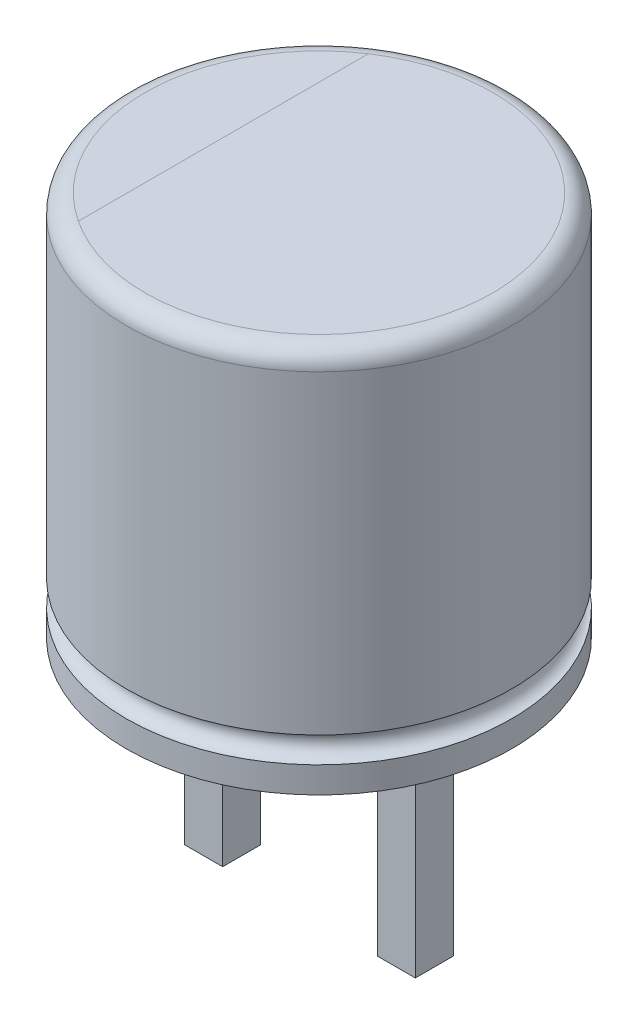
ISO-10303-21;
HEADER;
FILE_DESCRIPTION(('STEP AP214'),'2;1');
FILE_NAME('part.step','',(''),(''),'','','');
FILE_SCHEMA(('AUTOMOTIVE_DESIGN { 1 0 10303 214 1 1 1 1 }'));
ENDSEC;
DATA;
#1=APPLICATION_CONTEXT('core data for automotive mechanical design processes');
#2=APPLICATION_PROTOCOL_DEFINITION('international standard','automotive_design',2000,#1);
#3=PRODUCT_CONTEXT('',#1,'mechanical');
#4=PRODUCT('Part','Part','',(#3));
#5=PRODUCT_RELATED_PRODUCT_CATEGORY('part','',(#4));
#6=PRODUCT_DEFINITION_FORMATION('','',#4);
#7=PRODUCT_DEFINITION_CONTEXT('part definition',#1,'design');
#8=PRODUCT_DEFINITION('design','',#6,#7);
#9=PRODUCT_DEFINITION_SHAPE('','',#8);
#10=(LENGTH_UNIT() NAMED_UNIT(*) SI_UNIT(.MILLI.,.METRE.));
#11=(NAMED_UNIT(*) PLANE_ANGLE_UNIT() SI_UNIT($,.RADIAN.));
#12=(NAMED_UNIT(*) SI_UNIT($,.STERADIAN.) SOLID_ANGLE_UNIT());
#13=UNCERTAINTY_MEASURE_WITH_UNIT(LENGTH_MEASURE(1.E-05),#10,'distance_accuracy_value','');
#14=(GEOMETRIC_REPRESENTATION_CONTEXT(3) GLOBAL_UNCERTAINTY_ASSIGNED_CONTEXT((#13)) GLOBAL_UNIT_ASSIGNED_CONTEXT((#10,
#11,#12)) REPRESENTATION_CONTEXT('',''));
#15=CARTESIAN_POINT('',(0.,0.,0.));
#16=DIRECTION('',(0.,0.,1.));
#17=DIRECTION('',(1.,0.,0.));
#18=AXIS2_PLACEMENT_3D('',#15,#16,#17);
#19=CARTESIAN_POINT('',(0.,5.08,0.));
#20=DIRECTION('',(0.,-1.,0.));
#21=DIRECTION('',(0.,0.,-1.));
#22=AXIS2_PLACEMENT_3D('',#19,#20,#21);
#23=PLANE('',#22);
#24=DIRECTION('',(0.,0.,1.));
#25=VECTOR('',#24,1.);
#26=CARTESIAN_POINT('',(-1.26082186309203,5.08,0.));
#27=LINE('',#26,#25);
#28=CARTESIAN_POINT('',(-1.26082186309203,5.08,-1.91165588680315));
#29=VERTEX_POINT('',#28);
#30=CARTESIAN_POINT('',(-1.26082186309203,5.08,1.91165588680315));
#31=VERTEX_POINT('',#30);
#32=EDGE_CURVE('E11',#29,#31,#27,.T.);
#33=ORIENTED_EDGE('',*,*,#32,.F.);
#34=CARTESIAN_POINT('',(0.,5.08,0.));
#35=DIRECTION('',(0.,1.,0.));
#36=DIRECTION('',(0.,0.,1.));
#37=AXIS2_PLACEMENT_3D('',#34,#35,#36);
#38=CIRCLE('',#37,2.29);
#39=EDGE_CURVE('E49',#29,#31,#38,.T.);
#40=ORIENTED_EDGE('',*,*,#39,.T.);
#41=EDGE_LOOP('',(#33,#40));
#42=FACE_BOUND('',#41,.T.);
#43=ADVANCED_FACE('F40',(#42),#23,.F.);
#44=CARTESIAN_POINT('',(2.54,0.,0.));
#45=DIRECTION('',(0.,1.,0.));
#46=DIRECTION('',(0.,0.,1.));
#47=AXIS2_PLACEMENT_3D('',#44,#45,#46);
#48=PLANE('',#47);
#49=DIRECTION('',(0.,0.,-1.));
#50=VECTOR('',#49,1.);
#51=CARTESIAN_POINT('',(-1.52,0.,0.250000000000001));
#52=LINE('',#51,#50);
#53=CARTESIAN_POINT('',(-1.52,0.,0.250000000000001));
#54=VERTEX_POINT('',#53);
#55=CARTESIAN_POINT('',(-1.52,0.,-0.249999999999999));
#56=VERTEX_POINT('',#55);
#57=EDGE_CURVE('E133',#54,#56,#52,.T.);
#58=ORIENTED_EDGE('',*,*,#57,.F.);
#59=DIRECTION('',(-1.,0.,0.));
#60=VECTOR('',#59,1.);
#61=CARTESIAN_POINT('',(-1.52,0.,0.250000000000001));
#62=LINE('',#61,#60);
#63=CARTESIAN_POINT('',(-1.02,0.,0.250000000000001));
#64=VERTEX_POINT('',#63);
#65=EDGE_CURVE('E146',#64,#54,#62,.T.);
#66=ORIENTED_EDGE('',*,*,#65,.F.);
#67=DIRECTION('',(0.,0.,1.));
#68=VECTOR('',#67,1.);
#69=CARTESIAN_POINT('',(-1.02,0.,0.250000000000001));
#70=LINE('',#69,#68);
#71=CARTESIAN_POINT('',(-1.02,0.,-0.249999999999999));
#72=VERTEX_POINT('',#71);
#73=EDGE_CURVE('E155',#72,#64,#70,.T.);
#74=ORIENTED_EDGE('',*,*,#73,.F.);
#75=DIRECTION('',(1.,0.,0.));
#76=VECTOR('',#75,1.);
#77=CARTESIAN_POINT('',(-1.52,0.,-0.249999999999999));
#78=LINE('',#77,#76);
#79=EDGE_CURVE('E136',#56,#72,#78,.T.);
#80=ORIENTED_EDGE('',*,*,#79,.F.);
#81=EDGE_LOOP('',(#58,#66,#74,#80));
#82=FACE_BOUND('',#81,.T.);
#83=CARTESIAN_POINT('',(0.,0.,0.));
#84=DIRECTION('',(0.,1.,0.));
#85=DIRECTION('',(0.,0.,1.));
#86=AXIS2_PLACEMENT_3D('',#83,#84,#85);
#87=CIRCLE('',#86,2.54);
#88=CARTESIAN_POINT('',(0.,0.,2.54));
#89=VERTEX_POINT('',#88);
#90=EDGE_CURVE('E171',#89,#89,#87,.T.);
#91=ORIENTED_EDGE('',*,*,#90,.F.);
#92=EDGE_LOOP('',(#91));
#93=FACE_BOUND('',#92,.T.);
#94=DIRECTION('',(0.,0.,-1.));
#95=VECTOR('',#94,1.);
#96=CARTESIAN_POINT('',(1.02,0.,0.25));
#97=LINE('',#96,#95);
#98=CARTESIAN_POINT('',(1.02,0.,0.25));
#99=VERTEX_POINT('',#98);
#100=CARTESIAN_POINT('',(1.02,0.,-0.25));
#101=VERTEX_POINT('',#100);
#102=EDGE_CURVE('E132',#99,#101,#97,.T.);
#103=ORIENTED_EDGE('',*,*,#102,.F.);
#104=DIRECTION('',(-1.,0.,0.));
#105=VECTOR('',#104,1.);
#106=CARTESIAN_POINT('',(1.02,0.,0.25));
#107=LINE('',#106,#105);
#108=CARTESIAN_POINT('',(1.52,0.,0.25));
#109=VERTEX_POINT('',#108);
#110=EDGE_CURVE('E129',#109,#99,#107,.T.);
#111=ORIENTED_EDGE('',*,*,#110,.F.);
#112=DIRECTION('',(0.,0.,1.));
#113=VECTOR('',#112,1.);
#114=CARTESIAN_POINT('',(1.52,0.,0.25));
#115=LINE('',#114,#113);
#116=CARTESIAN_POINT('',(1.52,0.,-0.25));
#117=VERTEX_POINT('',#116);
#118=EDGE_CURVE('E223',#117,#109,#115,.T.);
#119=ORIENTED_EDGE('',*,*,#118,.F.);
#120=DIRECTION('',(1.,0.,0.));
#121=VECTOR('',#120,1.);
#122=CARTESIAN_POINT('',(1.02,0.,-0.25));
#123=LINE('',#122,#121);
#124=EDGE_CURVE('E216',#101,#117,#123,.T.);
#125=ORIENTED_EDGE('',*,*,#124,.F.);
#126=EDGE_LOOP('',(#103,#111,#119,#125));
#127=FACE_BOUND('',#126,.T.);
#128=ADVANCED_FACE('F42',(#82,#93,#127),#48,.F.);
#129=EDGE_CURVE('E182',#31,#29,#38,.T.);
#130=ORIENTED_EDGE('',*,*,#129,.T.);
#131=ORIENTED_EDGE('',*,*,#32,.T.);
#132=EDGE_LOOP('',(#130,#131));
#133=FACE_BOUND('',#132,.T.);
#134=ADVANCED_FACE('F184',(#133),#23,.F.);
#135=CARTESIAN_POINT('',(0.,4.83,0.));
#136=DIRECTION('',(0.,1.,0.));
#137=DIRECTION('',(0.,0.,1.));
#138=AXIS2_PLACEMENT_3D('',#135,#136,#137);
#139=TOROIDAL_SURFACE('',#138,2.29,0.25);
#140=ORIENTED_EDGE('',*,*,#39,.F.);
#141=ORIENTED_EDGE('',*,*,#129,.F.);
#142=EDGE_LOOP('',(#140,#141));
#143=FACE_BOUND('',#142,.T.);
#144=CARTESIAN_POINT('',(0.,4.83,0.));
#145=DIRECTION('',(0.,1.,0.));
#146=DIRECTION('',(0.,0.,1.));
#147=AXIS2_PLACEMENT_3D('',#144,#145,#146);
#148=CIRCLE('',#147,2.54);
#149=CARTESIAN_POINT('',(0.,4.83,2.54));
#150=VERTEX_POINT('',#149);
#151=EDGE_CURVE('E180',#150,#150,#148,.T.);
#152=ORIENTED_EDGE('',*,*,#151,.T.);
#153=EDGE_LOOP('',(#152));
#154=FACE_BOUND('',#153,.T.);
#155=ADVANCED_FACE('F186',(#143,#154),#139,.T.);
#156=CARTESIAN_POINT('',(0.,0.,0.));
#157=DIRECTION('',(0.,1.,0.));
#158=DIRECTION('',(0.,0.,1.));
#159=AXIS2_PLACEMENT_3D('',#156,#157,#158);
#160=CYLINDRICAL_SURFACE('',#159,2.54);
#161=ORIENTED_EDGE('',*,*,#151,.F.);
#162=EDGE_LOOP('',(#161));
#163=FACE_BOUND('',#162,.T.);
#164=CARTESIAN_POINT('',(0.,0.684358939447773,0.));
#165=DIRECTION('',(0.,1.,0.));
#166=DIRECTION('',(0.,0.,1.));
#167=AXIS2_PLACEMENT_3D('',#164,#165,#166);
#168=CIRCLE('',#167,2.54);
#169=CARTESIAN_POINT('',(0.,0.684358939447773,2.54));
#170=VERTEX_POINT('',#169);
#171=EDGE_CURVE('E177',#170,#170,#168,.T.);
#172=ORIENTED_EDGE('',*,*,#171,.T.);
#173=EDGE_LOOP('',(#172));
#174=FACE_BOUND('',#173,.T.);
#175=ADVANCED_FACE('F189',(#163,#174),#160,.T.);
#176=CARTESIAN_POINT('',(0.,0.514154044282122,0.));
#177=DIRECTION('',(0.,1.,0.));
#178=DIRECTION('',(0.,0.,1.));
#179=AXIS2_PLACEMENT_3D('',#176,#177,#178);
#180=TOROIDAL_SURFACE('',#179,2.54,0.170204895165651);
#181=ORIENTED_EDGE('',*,*,#171,.F.);
#182=EDGE_LOOP('',(#181));
#183=FACE_BOUND('',#182,.T.);
#184=CARTESIAN_POINT('',(0.,0.343949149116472,0.));
#185=DIRECTION('',(0.,1.,0.));
#186=DIRECTION('',(0.,0.,1.));
#187=AXIS2_PLACEMENT_3D('',#184,#185,#186);
#188=CIRCLE('',#187,2.54);
#189=CARTESIAN_POINT('',(0.,0.343949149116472,2.54));
#190=VERTEX_POINT('',#189);
#191=EDGE_CURVE('E174',#190,#190,#188,.T.);
#192=ORIENTED_EDGE('',*,*,#191,.T.);
#193=EDGE_LOOP('',(#192));
#194=FACE_BOUND('',#193,.T.);
#195=ADVANCED_FACE('F195',(#183,#194),#180,.F.);
#196=CARTESIAN_POINT('',(0.,0.,0.));
#197=DIRECTION('',(0.,1.,0.));
#198=DIRECTION('',(0.,0.,1.));
#199=AXIS2_PLACEMENT_3D('',#196,#197,#198);
#200=CYLINDRICAL_SURFACE('',#199,2.54);
#201=ORIENTED_EDGE('',*,*,#191,.F.);
#202=EDGE_LOOP('',(#201));
#203=FACE_BOUND('',#202,.T.);
#204=ORIENTED_EDGE('',*,*,#90,.T.);
#205=EDGE_LOOP('',(#204));
#206=FACE_BOUND('',#205,.T.);
#207=ADVANCED_FACE('F201',(#203,#206),#200,.T.);
#208=CARTESIAN_POINT('',(-1.52,-3.,0.250000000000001));
#209=DIRECTION('',(1.,0.,0.));
#210=DIRECTION('',(0.,0.,-1.));
#211=AXIS2_PLACEMENT_3D('',#208,#209,#210);
#212=PLANE('',#211);
#213=ORIENTED_EDGE('',*,*,#57,.T.);
#214=DIRECTION('',(0.,1.,0.));
#215=VECTOR('',#214,1.);
#216=CARTESIAN_POINT('',(-1.52,-3.,-0.249999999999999));
#217=LINE('',#216,#215);
#218=CARTESIAN_POINT('',(-1.52,-3.,-0.249999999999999));
#219=VERTEX_POINT('',#218);
#220=EDGE_CURVE('E168',#219,#56,#217,.T.);
#221=ORIENTED_EDGE('',*,*,#220,.F.);
#222=DIRECTION('',(0.,0.,-1.));
#223=VECTOR('',#222,1.);
#224=CARTESIAN_POINT('',(-1.52,-3.,0.250000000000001));
#225=LINE('',#224,#223);
#226=CARTESIAN_POINT('',(-1.52,-3.,0.250000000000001));
#227=VERTEX_POINT('',#226);
#228=EDGE_CURVE('E142',#227,#219,#225,.T.);
#229=ORIENTED_EDGE('',*,*,#228,.F.);
#230=DIRECTION('',(0.,1.,0.));
#231=VECTOR('',#230,1.);
#232=CARTESIAN_POINT('',(-1.52,-3.,0.250000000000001));
#233=LINE('',#232,#231);
#234=EDGE_CURVE('E151',#227,#54,#233,.T.);
#235=ORIENTED_EDGE('',*,*,#234,.T.);
#236=EDGE_LOOP('',(#213,#221,#229,#235));
#237=FACE_BOUND('',#236,.T.);
#238=ADVANCED_FACE('F207',(#237),#212,.F.);
#239=CARTESIAN_POINT('',(-1.52,-3.,-0.249999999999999));
#240=DIRECTION('',(0.,0.,1.));
#241=DIRECTION('',(1.,0.,0.));
#242=AXIS2_PLACEMENT_3D('',#239,#240,#241);
#243=PLANE('',#242);
#244=ORIENTED_EDGE('',*,*,#79,.T.);
#245=DIRECTION('',(0.,1.,0.));
#246=VECTOR('',#245,1.);
#247=CARTESIAN_POINT('',(-1.02,-3.,-0.249999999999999));
#248=LINE('',#247,#246);
#249=CARTESIAN_POINT('',(-1.02,-3.,-0.249999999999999));
#250=VERTEX_POINT('',#249);
#251=EDGE_CURVE('E165',#250,#72,#248,.T.);
#252=ORIENTED_EDGE('',*,*,#251,.F.);
#253=DIRECTION('',(1.,0.,0.));
#254=VECTOR('',#253,1.);
#255=CARTESIAN_POINT('',(-1.52,-3.,-0.249999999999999));
#256=LINE('',#255,#254);
#257=EDGE_CURVE('E145',#219,#250,#256,.T.);
#258=ORIENTED_EDGE('',*,*,#257,.F.);
#259=ORIENTED_EDGE('',*,*,#220,.T.);
#260=EDGE_LOOP('',(#244,#252,#258,#259));
#261=FACE_BOUND('',#260,.T.);
#262=ADVANCED_FACE('F270',(#261),#243,.F.);
#263=CARTESIAN_POINT('',(-1.02,-3.,0.250000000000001));
#264=DIRECTION('',(-1.,0.,0.));
#265=DIRECTION('',(0.,0.,1.));
#266=AXIS2_PLACEMENT_3D('',#263,#264,#265);
#267=PLANE('',#266);
#268=ORIENTED_EDGE('',*,*,#73,.T.);
#269=DIRECTION('',(0.,1.,0.));
#270=VECTOR('',#269,1.);
#271=CARTESIAN_POINT('',(-1.02,-3.,0.250000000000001));
#272=LINE('',#271,#270);
#273=CARTESIAN_POINT('',(-1.02,-3.,0.250000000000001));
#274=VERTEX_POINT('',#273);
#275=EDGE_CURVE('E162',#274,#64,#272,.T.);
#276=ORIENTED_EDGE('',*,*,#275,.F.);
#277=DIRECTION('',(0.,0.,1.));
#278=VECTOR('',#277,1.);
#279=CARTESIAN_POINT('',(-1.02,-3.,0.250000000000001));
#280=LINE('',#279,#278);
#281=EDGE_CURVE('E148',#250,#274,#280,.T.);
#282=ORIENTED_EDGE('',*,*,#281,.F.);
#283=ORIENTED_EDGE('',*,*,#251,.T.);
#284=EDGE_LOOP('',(#268,#276,#282,#283));
#285=FACE_BOUND('',#284,.T.);
#286=ADVANCED_FACE('F278',(#285),#267,.F.);
#287=CARTESIAN_POINT('',(-1.52,-3.,0.250000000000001));
#288=DIRECTION('',(0.,0.,-1.));
#289=DIRECTION('',(-1.,0.,0.));
#290=AXIS2_PLACEMENT_3D('',#287,#288,#289);
#291=PLANE('',#290);
#292=ORIENTED_EDGE('',*,*,#65,.T.);
#293=ORIENTED_EDGE('',*,*,#234,.F.);
#294=DIRECTION('',(-1.,0.,0.));
#295=VECTOR('',#294,1.);
#296=CARTESIAN_POINT('',(-1.52,-3.,0.250000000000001));
#297=LINE('',#296,#295);
#298=EDGE_CURVE('E150',#274,#227,#297,.T.);
#299=ORIENTED_EDGE('',*,*,#298,.F.);
#300=ORIENTED_EDGE('',*,*,#275,.T.);
#301=EDGE_LOOP('',(#292,#293,#299,#300));
#302=FACE_BOUND('',#301,.T.);
#303=ADVANCED_FACE('F286',(#302),#291,.F.);
#304=CARTESIAN_POINT('',(-1.52,-3.,-0.249999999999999));
#305=DIRECTION('',(0.,-1.,0.));
#306=DIRECTION('',(0.,0.,-1.));
#307=AXIS2_PLACEMENT_3D('',#304,#305,#306);
#308=PLANE('',#307);
#309=ORIENTED_EDGE('',*,*,#228,.T.);
#310=ORIENTED_EDGE('',*,*,#257,.T.);
#311=ORIENTED_EDGE('',*,*,#281,.T.);
#312=ORIENTED_EDGE('',*,*,#298,.T.);
#313=EDGE_LOOP('',(#309,#310,#311,#312));
#314=FACE_BOUND('',#313,.T.);
#315=ADVANCED_FACE('F294',(#314),#308,.T.);
#316=CARTESIAN_POINT('',(1.02,-3.,0.25));
#317=DIRECTION('',(1.,0.,0.));
#318=DIRECTION('',(0.,0.,-1.));
#319=AXIS2_PLACEMENT_3D('',#316,#317,#318);
#320=PLANE('',#319);
#321=ORIENTED_EDGE('',*,*,#102,.T.);
#322=DIRECTION('',(0.,1.,0.));
#323=VECTOR('',#322,1.);
#324=CARTESIAN_POINT('',(1.02,-3.,-0.25));
#325=LINE('',#324,#323);
#326=CARTESIAN_POINT('',(1.02,-3.,-0.25));
#327=VERTEX_POINT('',#326);
#328=EDGE_CURVE('E113',#327,#101,#325,.T.);
#329=ORIENTED_EDGE('',*,*,#328,.F.);
#330=DIRECTION('',(0.,0.,-1.));
#331=VECTOR('',#330,1.);
#332=CARTESIAN_POINT('',(1.02,-3.,0.25));
#333=LINE('',#332,#331);
#334=CARTESIAN_POINT('',(1.02,-3.,0.25));
#335=VERTEX_POINT('',#334);
#336=EDGE_CURVE('E120',#335,#327,#333,.T.);
#337=ORIENTED_EDGE('',*,*,#336,.F.);
#338=DIRECTION('',(0.,1.,0.));
#339=VECTOR('',#338,1.);
#340=CARTESIAN_POINT('',(1.02,-3.,0.25));
#341=LINE('',#340,#339);
#342=EDGE_CURVE('E221',#335,#99,#341,.T.);
#343=ORIENTED_EDGE('',*,*,#342,.T.);
#344=EDGE_LOOP('',(#321,#329,#337,#343));
#345=FACE_BOUND('',#344,.T.);
#346=ADVANCED_FACE('F131',(#345),#320,.F.);
#347=CARTESIAN_POINT('',(1.02,-3.,-0.25));
#348=DIRECTION('',(0.,0.,1.));
#349=DIRECTION('',(1.,0.,0.));
#350=AXIS2_PLACEMENT_3D('',#347,#348,#349);
#351=PLANE('',#350);
#352=ORIENTED_EDGE('',*,*,#124,.T.);
#353=DIRECTION('',(0.,1.,0.));
#354=VECTOR('',#353,1.);
#355=CARTESIAN_POINT('',(1.52,-3.,-0.25));
#356=LINE('',#355,#354);
#357=CARTESIAN_POINT('',(1.52,-3.,-0.25));
#358=VERTEX_POINT('',#357);
#359=EDGE_CURVE('E116',#358,#117,#356,.T.);
#360=ORIENTED_EDGE('',*,*,#359,.F.);
#361=DIRECTION('',(1.,0.,0.));
#362=VECTOR('',#361,1.);
#363=CARTESIAN_POINT('',(1.02,-3.,-0.25));
#364=LINE('',#363,#362);
#365=EDGE_CURVE('E108',#327,#358,#364,.T.);
#366=ORIENTED_EDGE('',*,*,#365,.F.);
#367=ORIENTED_EDGE('',*,*,#328,.T.);
#368=EDGE_LOOP('',(#352,#360,#366,#367));
#369=FACE_BOUND('',#368,.T.);
#370=ADVANCED_FACE('F111',(#369),#351,.F.);
#371=CARTESIAN_POINT('',(1.52,-3.,0.25));
#372=DIRECTION('',(-1.,0.,0.));
#373=DIRECTION('',(0.,0.,1.));
#374=AXIS2_PLACEMENT_3D('',#371,#372,#373);
#375=PLANE('',#374);
#376=ORIENTED_EDGE('',*,*,#118,.T.);
#377=DIRECTION('',(0.,1.,0.));
#378=VECTOR('',#377,1.);
#379=CARTESIAN_POINT('',(1.52,-3.,0.25));
#380=LINE('',#379,#378);
#381=CARTESIAN_POINT('',(1.52,-3.,0.25));
#382=VERTEX_POINT('',#381);
#383=EDGE_CURVE('E138',#382,#109,#380,.T.);
#384=ORIENTED_EDGE('',*,*,#383,.F.);
#385=DIRECTION('',(0.,0.,1.));
#386=VECTOR('',#385,1.);
#387=CARTESIAN_POINT('',(1.52,-3.,0.25));
#388=LINE('',#387,#386);
#389=EDGE_CURVE('E119',#358,#382,#388,.T.);
#390=ORIENTED_EDGE('',*,*,#389,.F.);
#391=ORIENTED_EDGE('',*,*,#359,.T.);
#392=EDGE_LOOP('',(#376,#384,#390,#391));
#393=FACE_BOUND('',#392,.T.);
#394=ADVANCED_FACE('F231',(#393),#375,.F.);
#395=CARTESIAN_POINT('',(1.02,-3.,0.25));
#396=DIRECTION('',(0.,0.,-1.));
#397=DIRECTION('',(-1.,0.,0.));
#398=AXIS2_PLACEMENT_3D('',#395,#396,#397);
#399=PLANE('',#398);
#400=ORIENTED_EDGE('',*,*,#110,.T.);
#401=ORIENTED_EDGE('',*,*,#342,.F.);
#402=DIRECTION('',(-1.,0.,0.));
#403=VECTOR('',#402,1.);
#404=CARTESIAN_POINT('',(1.02,-3.,0.25));
#405=LINE('',#404,#403);
#406=EDGE_CURVE('E125',#382,#335,#405,.T.);
#407=ORIENTED_EDGE('',*,*,#406,.F.);
#408=ORIENTED_EDGE('',*,*,#383,.T.);
#409=EDGE_LOOP('',(#400,#401,#407,#408));
#410=FACE_BOUND('',#409,.T.);
#411=ADVANCED_FACE('F220',(#410),#399,.F.);
#412=CARTESIAN_POINT('',(1.02,-3.,-0.25));
#413=DIRECTION('',(0.,-1.,0.));
#414=DIRECTION('',(0.,0.,-1.));
#415=AXIS2_PLACEMENT_3D('',#412,#413,#414);
#416=PLANE('',#415);
#417=ORIENTED_EDGE('',*,*,#336,.T.);
#418=ORIENTED_EDGE('',*,*,#365,.T.);
#419=ORIENTED_EDGE('',*,*,#389,.T.);
#420=ORIENTED_EDGE('',*,*,#406,.T.);
#421=EDGE_LOOP('',(#417,#418,#419,#420));
#422=FACE_BOUND('',#421,.T.);
#423=ADVANCED_FACE('F123',(#422),#416,.T.);
#424=CLOSED_SHELL('',(#43,#128,#134,#155,#175,#195,#207,#238,#262,#286,#303,#315,#346,#370,#394,
#411,#423));
#425=MANIFOLD_SOLID_BREP('B2',#424);
#426=ADVANCED_BREP_SHAPE_REPRESENTATION('',(#18,#425),#14);
#427=SHAPE_DEFINITION_REPRESENTATION(#9,#426);
ENDSEC;
END-ISO-10303-21;
